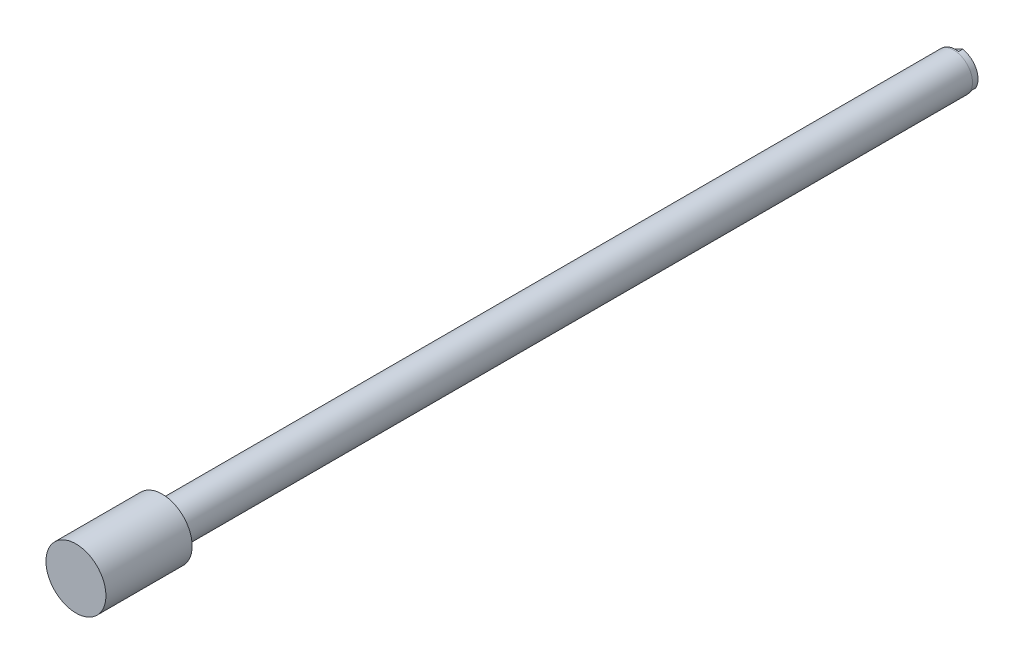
ISO-10303-21;
HEADER;
FILE_DESCRIPTION(('STEP AP214'),'2;1');
FILE_NAME('part.step','',(''),(''),'','','');
FILE_SCHEMA(('AUTOMOTIVE_DESIGN { 1 0 10303 214 1 1 1 1 }'));
ENDSEC;
DATA;
#1=APPLICATION_CONTEXT('core data for automotive mechanical design processes');
#2=APPLICATION_PROTOCOL_DEFINITION('international standard','automotive_design',2000,#1);
#3=PRODUCT_CONTEXT('',#1,'mechanical');
#4=PRODUCT('Part','Part','',(#3));
#5=PRODUCT_RELATED_PRODUCT_CATEGORY('part','',(#4));
#6=PRODUCT_DEFINITION_FORMATION('','',#4);
#7=PRODUCT_DEFINITION_CONTEXT('part definition',#1,'design');
#8=PRODUCT_DEFINITION('design','',#6,#7);
#9=PRODUCT_DEFINITION_SHAPE('','',#8);
#10=(LENGTH_UNIT() NAMED_UNIT(*) SI_UNIT(.MILLI.,.METRE.));
#11=(NAMED_UNIT(*) PLANE_ANGLE_UNIT() SI_UNIT($,.RADIAN.));
#12=(NAMED_UNIT(*) SI_UNIT($,.STERADIAN.) SOLID_ANGLE_UNIT());
#13=UNCERTAINTY_MEASURE_WITH_UNIT(LENGTH_MEASURE(1.E-05),#10,'distance_accuracy_value','');
#14=(GEOMETRIC_REPRESENTATION_CONTEXT(3) GLOBAL_UNCERTAINTY_ASSIGNED_CONTEXT((#13)) GLOBAL_UNIT_ASSIGNED_CONTEXT((#10,
#11,#12)) REPRESENTATION_CONTEXT('',''));
#15=CARTESIAN_POINT('',(0.,0.,0.));
#16=DIRECTION('',(0.,0.,1.));
#17=DIRECTION('',(1.,0.,0.));
#18=AXIS2_PLACEMENT_3D('',#15,#16,#17);
#19=CARTESIAN_POINT('',(0.,0.,39.5986));
#20=DIRECTION('',(0.,0.,-1.));
#21=DIRECTION('',(-1.,0.,0.));
#22=AXIS2_PLACEMENT_3D('',#19,#20,#21);
#23=CYLINDRICAL_SURFACE('',#22,7.25);
#24=CARTESIAN_POINT('',(0.,0.,33.528));
#25=DIRECTION('',(0.,0.,-1.));
#26=DIRECTION('',(0.,1.,0.));
#27=AXIS2_PLACEMENT_3D('',#24,#25,#26);
#28=CIRCLE('',#27,7.25);
#29=CARTESIAN_POINT('',(0.,7.25,33.528));
#30=VERTEX_POINT('',#29);
#31=EDGE_CURVE('E25',#30,#30,#28,.T.);
#32=ORIENTED_EDGE('',*,*,#31,.F.);
#33=EDGE_LOOP('',(#32));
#34=FACE_BOUND('',#33,.T.);
#35=CARTESIAN_POINT('',(0.,0.,0.));
#36=DIRECTION('',(0.,0.,-1.));
#37=DIRECTION('',(0.898794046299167,0.438371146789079,0.));
#38=AXIS2_PLACEMENT_3D('',#35,#36,#37);
#39=CIRCLE('',#38,7.25);
#40=CARTESIAN_POINT('',(6.51625683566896,3.17819081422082,0.));
#41=VERTEX_POINT('',#40);
#42=EDGE_CURVE('E77',#41,#41,#39,.T.);
#43=ORIENTED_EDGE('',*,*,#42,.T.);
#44=EDGE_LOOP('',(#43));
#45=FACE_BOUND('',#44,.T.);
#46=ADVANCED_FACE('F16',(#34,#45),#23,.F.);
#47=CARTESIAN_POINT('',(0.,0.,748.2776000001));
#48=DIRECTION('',(0.,0.,1.));
#49=DIRECTION('',(1.,0.,0.));
#50=AXIS2_PLACEMENT_3D('',#47,#48,#49);
#51=PLANE('',#50);
#52=CARTESIAN_POINT('',(0.,0.,748.2776000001));
#53=DIRECTION('',(0.,0.,1.));
#54=DIRECTION('',(1.,0.,0.));
#55=AXIS2_PLACEMENT_3D('',#52,#53,#54);
#56=CIRCLE('',#55,25.4);
#57=CARTESIAN_POINT('',(25.4,0.,748.2776000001));
#58=VERTEX_POINT('',#57);
#59=EDGE_CURVE('E109',#58,#58,#56,.T.);
#60=ORIENTED_EDGE('',*,*,#59,.T.);
#61=EDGE_LOOP('',(#60));
#62=FACE_BOUND('',#61,.T.);
#63=ADVANCED_FACE('F134',(#62),#51,.T.);
#64=CARTESIAN_POINT('',(0.,0.,748.2776000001));
#65=DIRECTION('',(0.,0.,-1.));
#66=DIRECTION('',(-1.,0.,0.));
#67=AXIS2_PLACEMENT_3D('',#64,#65,#66);
#68=CYLINDRICAL_SURFACE('',#67,25.4);
#69=ORIENTED_EDGE('',*,*,#59,.F.);
#70=EDGE_LOOP('',(#69));
#71=FACE_BOUND('',#70,.T.);
#72=CARTESIAN_POINT('',(0.,0.,675.2526000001));
#73=DIRECTION('',(0.,0.,1.));
#74=DIRECTION('',(1.,0.,0.));
#75=AXIS2_PLACEMENT_3D('',#72,#73,#74);
#76=CIRCLE('',#75,25.4);
#77=CARTESIAN_POINT('',(25.4,0.,675.2526000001));
#78=VERTEX_POINT('',#77);
#79=EDGE_CURVE('E106',#78,#78,#76,.T.);
#80=ORIENTED_EDGE('',*,*,#79,.T.);
#81=EDGE_LOOP('',(#80));
#82=FACE_BOUND('',#81,.T.);
#83=ADVANCED_FACE('F123',(#71,#82),#68,.T.);
#84=CARTESIAN_POINT('',(0.,0.,675.2526000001));
#85=DIRECTION('',(0.,0.,1.));
#86=DIRECTION('',(1.,0.,0.));
#87=AXIS2_PLACEMENT_3D('',#84,#85,#86);
#88=PLANE('',#87);
#89=CARTESIAN_POINT('',(0.,0.,675.2526000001));
#90=DIRECTION('',(0.,0.,1.));
#91=DIRECTION('',(1.,0.,0.));
#92=AXIS2_PLACEMENT_3D('',#89,#90,#91);
#93=CIRCLE('',#92,15.875);
#94=CARTESIAN_POINT('',(15.875,0.,675.2526000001));
#95=VERTEX_POINT('',#94);
#96=EDGE_CURVE('E73',#95,#95,#93,.F.);
#97=ORIENTED_EDGE('',*,*,#96,.F.);
#98=EDGE_LOOP('',(#97));
#99=FACE_BOUND('',#98,.T.);
#100=ORIENTED_EDGE('',*,*,#79,.F.);
#101=EDGE_LOOP('',(#100));
#102=FACE_BOUND('',#101,.T.);
#103=ADVANCED_FACE('F120',(#99,#102),#88,.F.);
#104=CARTESIAN_POINT('',(0.,0.,675.2526000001));
#105=DIRECTION('',(0.,0.,-1.));
#106=DIRECTION('',(-1.,0.,0.));
#107=AXIS2_PLACEMENT_3D('',#104,#105,#106);
#108=CYLINDRICAL_SURFACE('',#107,15.875);
#109=CARTESIAN_POINT('',(0.,0.,4.7752));
#110=DIRECTION('',(0.,0.,-1.));
#111=DIRECTION('',(-1.,0.,0.));
#112=AXIS2_PLACEMENT_3D('',#109,#110,#111);
#113=CIRCLE('',#112,15.875);
#114=CARTESIAN_POINT('',(-15.875,0.,4.7752));
#115=VERTEX_POINT('',#114);
#116=EDGE_CURVE('E70',#115,#115,#113,.T.);
#117=ORIENTED_EDGE('',*,*,#116,.F.);
#118=EDGE_LOOP('',(#117));
#119=FACE_BOUND('',#118,.T.);
#120=ORIENTED_EDGE('',*,*,#96,.T.);
#121=EDGE_LOOP('',(#120));
#122=FACE_BOUND('',#121,.T.);
#123=ADVANCED_FACE('F118',(#119,#122),#108,.T.);
#124=CARTESIAN_POINT('',(0.,0.,4.7752));
#125=DIRECTION('',(0.,0.,-1.));
#126=DIRECTION('',(-1.,0.,0.));
#127=AXIS2_PLACEMENT_3D('',#124,#125,#126);
#128=PLANE('',#127);
#129=CARTESIAN_POINT('',(0.,0.,4.7752));
#130=DIRECTION('',(0.,0.,-1.));
#131=DIRECTION('',(0.,1.,0.));
#132=AXIS2_PLACEMENT_3D('',#129,#130,#131);
#133=CIRCLE('',#132,15.7607);
#134=CARTESIAN_POINT('',(0.,15.7607,4.7752));
#135=VERTEX_POINT('',#134);
#136=EDGE_CURVE('E10',#135,#135,#133,.T.);
#137=ORIENTED_EDGE('',*,*,#136,.F.);
#138=EDGE_LOOP('',(#137));
#139=FACE_BOUND('',#138,.T.);
#140=ORIENTED_EDGE('',*,*,#116,.T.);
#141=EDGE_LOOP('',(#140));
#142=FACE_BOUND('',#141,.T.);
#143=ADVANCED_FACE('F131',(#139,#142),#128,.T.);
#144=CARTESIAN_POINT('',(0.,0.,3.556));
#145=DIRECTION('',(0.,0.,-1.));
#146=DIRECTION('',(0.898794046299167,0.438371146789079,0.));
#147=AXIS2_PLACEMENT_3D('',#144,#145,#146);
#148=PLANE('',#147);
#149=CARTESIAN_POINT('',(0.,0.,3.556));
#150=DIRECTION('',(0.,0.,-1.));
#151=DIRECTION('',(0.898794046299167,0.438371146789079,0.));
#152=AXIS2_PLACEMENT_3D('',#149,#150,#151);
#153=CIRCLE('',#152,15.7607);
#154=CARTESIAN_POINT('',(-13.9559883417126,7.32325432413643,3.556));
#155=VERTEX_POINT('',#154);
#156=CARTESIAN_POINT('',(2.82136121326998,15.5061144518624,3.556));
#157=VERTEX_POINT('',#156);
#158=EDGE_CURVE('E81',#155,#157,#153,.T.);
#159=ORIENTED_EDGE('',*,*,#158,.T.);
#160=DIRECTION('',(-0.898794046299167,-0.438371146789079,0.));
#161=VECTOR('',#160,1.);
#162=CARTESIAN_POINT('',(-13.9559883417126,7.32325432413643,3.556));
#163=LINE('',#162,#161);
#164=EDGE_CURVE('E83',#157,#155,#163,.T.);
#165=ORIENTED_EDGE('',*,*,#164,.T.);
#166=EDGE_LOOP('',(#159,#165));
#167=FACE_BOUND('',#166,.T.);
#168=ADVANCED_FACE('F141',(#167),#148,.T.);
#169=CARTESIAN_POINT('',(0.,0.,3.556));
#170=DIRECTION('',(0.,0.,-1.));
#171=DIRECTION('',(0.898794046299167,0.438371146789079,0.));
#172=AXIS2_PLACEMENT_3D('',#169,#170,#171);
#173=PLANE('',#172);
#174=CARTESIAN_POINT('',(0.,0.,3.556));
#175=DIRECTION('',(0.,0.,-1.));
#176=DIRECTION('',(0.898794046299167,0.438371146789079,0.));
#177=AXIS2_PLACEMENT_3D('',#174,#175,#176);
#178=CIRCLE('',#177,15.7607);
#179=CARTESIAN_POINT('',(13.9559883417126,-7.32325432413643,3.556));
#180=VERTEX_POINT('',#179);
#181=CARTESIAN_POINT('',(-2.82136121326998,-15.5061144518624,3.556));
#182=VERTEX_POINT('',#181);
#183=EDGE_CURVE('E92',#180,#182,#178,.T.);
#184=ORIENTED_EDGE('',*,*,#183,.T.);
#185=DIRECTION('',(0.898794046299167,0.438371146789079,0.));
#186=VECTOR('',#185,1.);
#187=CARTESIAN_POINT('',(-2.82136121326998,-15.5061144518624,3.556));
#188=LINE('',#187,#186);
#189=EDGE_CURVE('E94',#182,#180,#188,.T.);
#190=ORIENTED_EDGE('',*,*,#189,.T.);
#191=EDGE_LOOP('',(#184,#190));
#192=FACE_BOUND('',#191,.T.);
#193=ADVANCED_FACE('F146',(#192),#173,.T.);
#194=CARTESIAN_POINT('',(-2.82136121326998,-15.5061144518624,3.556));
#195=DIRECTION('',(-0.438371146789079,0.898794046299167,0.));
#196=DIRECTION('',(0.,0.,1.));
#197=AXIS2_PLACEMENT_3D('',#194,#195,#196);
#198=PLANE('',#197);
#199=DIRECTION('',(0.898794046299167,0.438371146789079,0.));
#200=VECTOR('',#199,1.);
#201=CARTESIAN_POINT('',(-2.82136121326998,-15.5061144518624,0.));
#202=LINE('',#201,#200);
#203=CARTESIAN_POINT('',(-2.82136121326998,-15.5061144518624,0.));
#204=VERTEX_POINT('',#203);
#205=CARTESIAN_POINT('',(13.9559883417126,-7.32325432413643,0.));
#206=VERTEX_POINT('',#205);
#207=EDGE_CURVE('E90',#204,#206,#202,.T.);
#208=ORIENTED_EDGE('',*,*,#207,.T.);
#209=DIRECTION('',(0.,0.,-1.));
#210=VECTOR('',#209,1.);
#211=CARTESIAN_POINT('',(13.9559883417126,-7.32325432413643,3.556));
#212=LINE('',#211,#210);
#213=EDGE_CURVE('E98',#180,#206,#212,.T.);
#214=ORIENTED_EDGE('',*,*,#213,.F.);
#215=ORIENTED_EDGE('',*,*,#189,.F.);
#216=DIRECTION('',(0.,0.,-1.));
#217=VECTOR('',#216,1.);
#218=CARTESIAN_POINT('',(-2.82136121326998,-15.5061144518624,3.556));
#219=LINE('',#218,#217);
#220=EDGE_CURVE('E41',#182,#204,#219,.T.);
#221=ORIENTED_EDGE('',*,*,#220,.T.);
#222=EDGE_LOOP('',(#208,#214,#215,#221));
#223=FACE_BOUND('',#222,.T.);
#224=ADVANCED_FACE('F154',(#223),#198,.F.);
#225=CARTESIAN_POINT('',(0.,0.,0.));
#226=DIRECTION('',(0.,0.,-1.));
#227=DIRECTION('',(0.898794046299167,0.438371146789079,0.));
#228=AXIS2_PLACEMENT_3D('',#225,#226,#227);
#229=PLANE('',#228);
#230=ORIENTED_EDGE('',*,*,#42,.F.);
#231=EDGE_LOOP('',(#230));
#232=FACE_BOUND('',#231,.T.);
#233=DIRECTION('',(-0.898794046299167,-0.438371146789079,0.));
#234=VECTOR('',#233,1.);
#235=CARTESIAN_POINT('',(-13.9559883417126,7.32325432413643,0.));
#236=LINE('',#235,#234);
#237=CARTESIAN_POINT('',(2.82136121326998,15.5061144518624,0.));
#238=VERTEX_POINT('',#237);
#239=CARTESIAN_POINT('',(-13.9559883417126,7.32325432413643,0.));
#240=VERTEX_POINT('',#239);
#241=EDGE_CURVE('E80',#238,#240,#236,.T.);
#242=ORIENTED_EDGE('',*,*,#241,.F.);
#243=CARTESIAN_POINT('',(0.,0.,0.));
#244=DIRECTION('',(0.,0.,-1.));
#245=DIRECTION('',(0.898794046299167,0.438371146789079,0.));
#246=AXIS2_PLACEMENT_3D('',#243,#244,#245);
#247=CIRCLE('',#246,15.7607);
#248=EDGE_CURVE('E100',#238,#206,#247,.T.);
#249=ORIENTED_EDGE('',*,*,#248,.T.);
#250=ORIENTED_EDGE('',*,*,#207,.F.);
#251=EDGE_CURVE('E20',#204,#240,#247,.T.);
#252=ORIENTED_EDGE('',*,*,#251,.T.);
#253=EDGE_LOOP('',(#242,#249,#250,#252));
#254=FACE_BOUND('',#253,.T.);
#255=ADVANCED_FACE('F151',(#232,#254),#229,.T.);
#256=CARTESIAN_POINT('',(-13.9559883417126,7.32325432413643,3.556));
#257=DIRECTION('',(0.438371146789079,-0.898794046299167,0.));
#258=DIRECTION('',(0.,0.,-1.));
#259=AXIS2_PLACEMENT_3D('',#256,#257,#258);
#260=PLANE('',#259);
#261=ORIENTED_EDGE('',*,*,#241,.T.);
#262=DIRECTION('',(0.,0.,-1.));
#263=VECTOR('',#262,1.);
#264=CARTESIAN_POINT('',(-13.9559883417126,7.32325432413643,3.556));
#265=LINE('',#264,#263);
#266=EDGE_CURVE('E87',#155,#240,#265,.T.);
#267=ORIENTED_EDGE('',*,*,#266,.F.);
#268=ORIENTED_EDGE('',*,*,#164,.F.);
#269=DIRECTION('',(0.,0.,-1.));
#270=VECTOR('',#269,1.);
#271=CARTESIAN_POINT('',(2.82136121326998,15.5061144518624,3.556));
#272=LINE('',#271,#270);
#273=EDGE_CURVE('E33',#157,#238,#272,.T.);
#274=ORIENTED_EDGE('',*,*,#273,.T.);
#275=EDGE_LOOP('',(#261,#267,#268,#274));
#276=FACE_BOUND('',#275,.T.);
#277=ADVANCED_FACE('F148',(#276),#260,.F.);
#278=CARTESIAN_POINT('',(0.,0.,4.7752));
#279=DIRECTION('',(0.,0.,-1.));
#280=DIRECTION('',(0.898794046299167,0.438371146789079,0.));
#281=AXIS2_PLACEMENT_3D('',#278,#279,#280);
#282=CYLINDRICAL_SURFACE('',#281,15.7607);
#283=ORIENTED_EDGE('',*,*,#266,.T.);
#284=ORIENTED_EDGE('',*,*,#251,.F.);
#285=ORIENTED_EDGE('',*,*,#220,.F.);
#286=ORIENTED_EDGE('',*,*,#183,.F.);
#287=ORIENTED_EDGE('',*,*,#213,.T.);
#288=ORIENTED_EDGE('',*,*,#248,.F.);
#289=ORIENTED_EDGE('',*,*,#273,.F.);
#290=ORIENTED_EDGE('',*,*,#158,.F.);
#291=EDGE_LOOP('',(#283,#284,#285,#286,#287,#288,#289,#290));
#292=FACE_BOUND('',#291,.T.);
#293=ORIENTED_EDGE('',*,*,#136,.T.);
#294=EDGE_LOOP('',(#293));
#295=FACE_BOUND('',#294,.T.);
#296=ADVANCED_FACE('F18',(#292,#295),#282,.T.);
#297=CARTESIAN_POINT('',(0.,0.,33.528));
#298=DIRECTION('',(0.,0.,-1.));
#299=DIRECTION('',(0.898794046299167,0.438371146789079,0.));
#300=AXIS2_PLACEMENT_3D('',#297,#298,#299);
#301=CONICAL_SURFACE('',#300,7.25,1.02974425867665);
#302=CARTESIAN_POINT('',(0.,0.,37.8842394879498));
#303=VERTEX_POINT('',#302);
#304=VERTEX_LOOP('',#303);
#305=FACE_BOUND('',#304,.T.);
#306=ORIENTED_EDGE('',*,*,#31,.T.);
#307=EDGE_LOOP('',(#306));
#308=FACE_BOUND('',#307,.T.);
#309=ADVANCED_FACE('F63',(#305,#308),#301,.F.);
#310=CLOSED_SHELL('',(#46,#63,#83,#103,#123,#143,#168,#193,#224,#255,#277,#296,#309));
#311=MANIFOLD_SOLID_BREP('B1',#310);
#312=ADVANCED_BREP_SHAPE_REPRESENTATION('',(#18,#311),#14);
#313=SHAPE_DEFINITION_REPRESENTATION(#9,#312);
ENDSEC;
END-ISO-10303-21;
